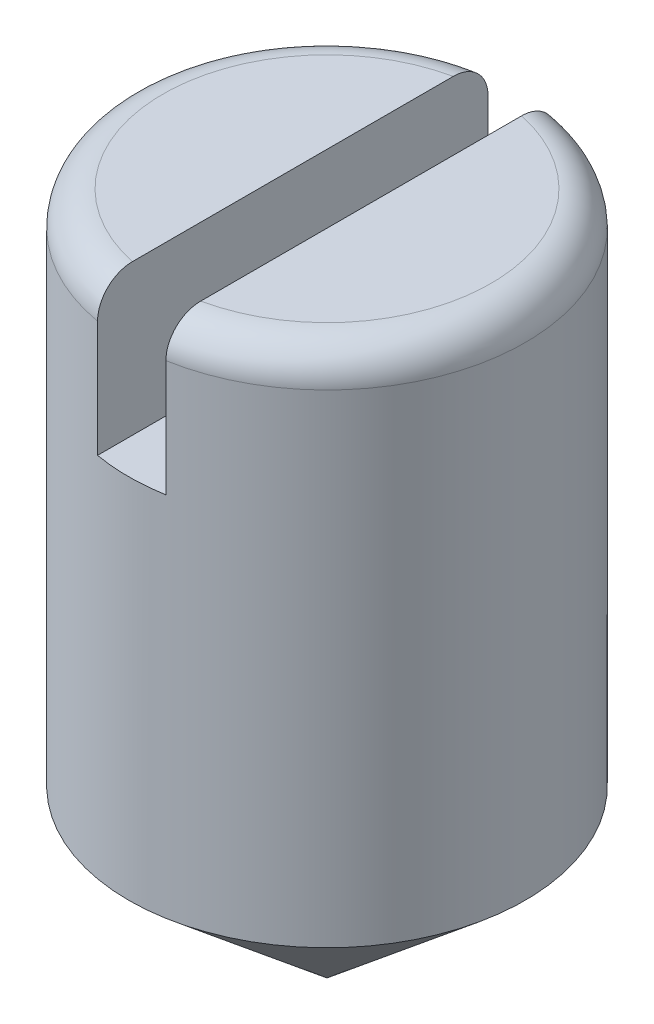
from build123d import *

# Parameters (mm, degrees)
ESQUISSE2_W             = 0.5
ESQUISSE2_H             = 1.1
ENL_V_MAT_EXTRU_1_DEPTH = 2
CONG_1_R                = 0.25


with BuildPart() as part:
    # Esquisse1 → R_volution1 (revolve)
    with BuildSketch(Plane.XY, mode=Mode.PRIVATE) as r_volution1_sk:
        Polygon((0, 5), (1.45, 5), (1.45, 1.216694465), (0, 0), align=None)
    revolve(r_volution1_sk.sketch.rotate(Axis((0, -16.329124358, 0), (0, 1, 0)), 90), axis=Axis((0, -16.329124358, 0), (0, 1, 0)))

    # Esquisse2 → Enl_v. mat.-Extru.1 (cut, symmetric)
    with BuildSketch(Plane.XY):
        with Locations((0, 4.45)):
            Rectangle(ESQUISSE2_W, ESQUISSE2_H)
    extrude(amount=ENL_V_MAT_EXTRU_1_DEPTH, both=True, mode=Mode.SUBTRACT)

    # Cong_1
    cong_1_edges = [part.edges().sort_by_distance(p)[0] for p in [
        (1.45, 5, 0),
        (-1.45, 5, 0),
    ]]
    fillet(cong_1_edges, radius=CONG_1_R)


solid = part.part
